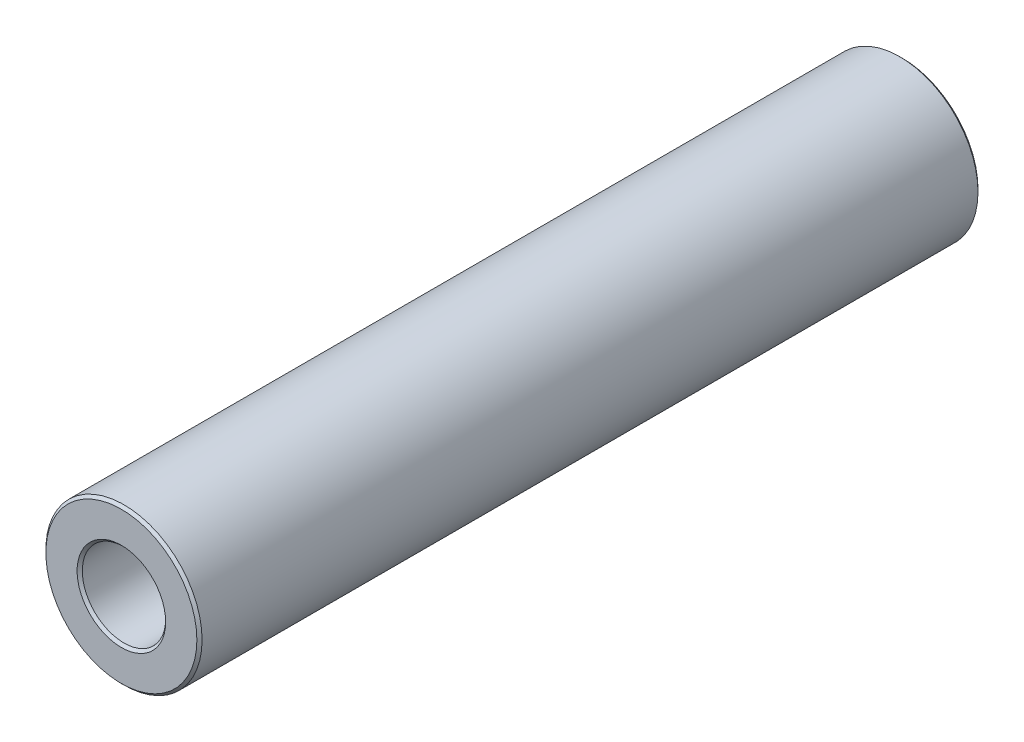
ISO-10303-21;
HEADER;
FILE_DESCRIPTION(('STEP AP214'),'2;1');
FILE_NAME('part.step','',(''),(''),'','','');
FILE_SCHEMA(('AUTOMOTIVE_DESIGN { 1 0 10303 214 1 1 1 1 }'));
ENDSEC;
DATA;
#1=APPLICATION_CONTEXT('core data for automotive mechanical design processes');
#2=APPLICATION_PROTOCOL_DEFINITION('international standard','automotive_design',2000,#1);
#3=PRODUCT_CONTEXT('',#1,'mechanical');
#4=PRODUCT('Part','Part','',(#3));
#5=PRODUCT_RELATED_PRODUCT_CATEGORY('part','',(#4));
#6=PRODUCT_DEFINITION_FORMATION('','',#4);
#7=PRODUCT_DEFINITION_CONTEXT('part definition',#1,'design');
#8=PRODUCT_DEFINITION('design','',#6,#7);
#9=PRODUCT_DEFINITION_SHAPE('','',#8);
#10=(LENGTH_UNIT() NAMED_UNIT(*) SI_UNIT(.MILLI.,.METRE.));
#11=(NAMED_UNIT(*) PLANE_ANGLE_UNIT() SI_UNIT($,.RADIAN.));
#12=(NAMED_UNIT(*) SI_UNIT($,.STERADIAN.) SOLID_ANGLE_UNIT());
#13=UNCERTAINTY_MEASURE_WITH_UNIT(LENGTH_MEASURE(1.E-05),#10,'distance_accuracy_value','');
#14=(GEOMETRIC_REPRESENTATION_CONTEXT(3) GLOBAL_UNCERTAINTY_ASSIGNED_CONTEXT((#13)) GLOBAL_UNIT_ASSIGNED_CONTEXT((#10,
#11,#12)) REPRESENTATION_CONTEXT('',''));
#15=CARTESIAN_POINT('',(0.,0.,0.));
#16=DIRECTION('',(0.,0.,1.));
#17=DIRECTION('',(1.,0.,0.));
#18=AXIS2_PLACEMENT_3D('',#15,#16,#17);
#19=CARTESIAN_POINT('',(0.,0.,15.));
#20=DIRECTION('',(0.,0.,1.));
#21=DIRECTION('',(1.,0.,0.));
#22=AXIS2_PLACEMENT_3D('',#19,#20,#21);
#23=PLANE('',#22);
#24=CARTESIAN_POINT('',(0.,0.,15.));
#25=DIRECTION('',(0.,0.,1.));
#26=DIRECTION('',(1.,0.,0.));
#27=AXIS2_PLACEMENT_3D('',#24,#25,#26);
#28=CIRCLE('',#27,1.7);
#29=CARTESIAN_POINT('',(1.7,0.,15.));
#30=VERTEX_POINT('',#29);
#31=EDGE_CURVE('E10',#30,#30,#28,.F.);
#32=ORIENTED_EDGE('',*,*,#31,.T.);
#33=EDGE_LOOP('',(#32));
#34=FACE_BOUND('',#33,.T.);
#35=CARTESIAN_POINT('',(0.,0.,15.));
#36=DIRECTION('',(0.,0.,1.));
#37=DIRECTION('',(1.,0.,0.));
#38=AXIS2_PLACEMENT_3D('',#35,#36,#37);
#39=CIRCLE('',#38,2.9);
#40=CARTESIAN_POINT('',(2.9,0.,15.));
#41=VERTEX_POINT('',#40);
#42=EDGE_CURVE('E45',#41,#41,#39,.T.);
#43=ORIENTED_EDGE('',*,*,#42,.T.);
#44=EDGE_LOOP('',(#43));
#45=FACE_BOUND('',#44,.T.);
#46=ADVANCED_FACE('F37',(#34,#45),#23,.T.);
#47=CARTESIAN_POINT('',(0.,0.,-15.));
#48=DIRECTION('',(0.,0.,1.));
#49=DIRECTION('',(1.,0.,0.));
#50=AXIS2_PLACEMENT_3D('',#47,#48,#49);
#51=PLANE('',#50);
#52=CARTESIAN_POINT('',(0.,0.,-15.));
#53=DIRECTION('',(0.,0.,1.));
#54=DIRECTION('',(1.,0.,0.));
#55=AXIS2_PLACEMENT_3D('',#52,#53,#54);
#56=CIRCLE('',#55,2.9);
#57=CARTESIAN_POINT('',(2.9,0.,-15.));
#58=VERTEX_POINT('',#57);
#59=EDGE_CURVE('E63',#58,#58,#56,.F.);
#60=ORIENTED_EDGE('',*,*,#59,.T.);
#61=EDGE_LOOP('',(#60));
#62=FACE_BOUND('',#61,.T.);
#63=CARTESIAN_POINT('',(0.,0.,-15.));
#64=DIRECTION('',(0.,0.,1.));
#65=DIRECTION('',(1.,0.,0.));
#66=AXIS2_PLACEMENT_3D('',#63,#64,#65);
#67=CIRCLE('',#66,1.7);
#68=CARTESIAN_POINT('',(1.7,0.,-15.));
#69=VERTEX_POINT('',#68);
#70=EDGE_CURVE('E66',#69,#69,#67,.T.);
#71=ORIENTED_EDGE('',*,*,#70,.T.);
#72=EDGE_LOOP('',(#71));
#73=FACE_BOUND('',#72,.T.);
#74=ADVANCED_FACE('F89',(#62,#73),#51,.F.);
#75=CARTESIAN_POINT('',(0.,0.,15.));
#76=DIRECTION('',(0.,0.,-1.));
#77=DIRECTION('',(-1.,0.,0.));
#78=AXIS2_PLACEMENT_3D('',#75,#76,#77);
#79=CYLINDRICAL_SURFACE('',#78,3.);
#80=CARTESIAN_POINT('',(0.,0.,-14.9));
#81=DIRECTION('',(0.,0.,1.));
#82=DIRECTION('',(1.,0.,0.));
#83=AXIS2_PLACEMENT_3D('',#80,#81,#82);
#84=CIRCLE('',#83,3.);
#85=CARTESIAN_POINT('',(3.,0.,-14.9));
#86=VERTEX_POINT('',#85);
#87=EDGE_CURVE('E69',#86,#86,#84,.T.);
#88=ORIENTED_EDGE('',*,*,#87,.T.);
#89=EDGE_LOOP('',(#88));
#90=FACE_BOUND('',#89,.T.);
#91=CARTESIAN_POINT('',(0.,0.,14.9));
#92=DIRECTION('',(0.,0.,1.));
#93=DIRECTION('',(1.,0.,0.));
#94=AXIS2_PLACEMENT_3D('',#91,#92,#93);
#95=CIRCLE('',#94,3.);
#96=CARTESIAN_POINT('',(3.,0.,14.9));
#97=VERTEX_POINT('',#96);
#98=EDGE_CURVE('E73',#97,#97,#95,.F.);
#99=ORIENTED_EDGE('',*,*,#98,.T.);
#100=EDGE_LOOP('',(#99));
#101=FACE_BOUND('',#100,.T.);
#102=ADVANCED_FACE('F78',(#90,#101),#79,.T.);
#103=CARTESIAN_POINT('',(0.,0.,15.));
#104=DIRECTION('',(0.,0.,-1.));
#105=DIRECTION('',(-1.,0.,0.));
#106=AXIS2_PLACEMENT_3D('',#103,#104,#105);
#107=CYLINDRICAL_SURFACE('',#106,1.6);
#108=CARTESIAN_POINT('',(0.,0.,-14.9));
#109=DIRECTION('',(0.,0.,1.));
#110=DIRECTION('',(1.,0.,0.));
#111=AXIS2_PLACEMENT_3D('',#108,#109,#110);
#112=CIRCLE('',#111,1.6);
#113=CARTESIAN_POINT('',(1.6,0.,-14.9));
#114=VERTEX_POINT('',#113);
#115=EDGE_CURVE('E51',#114,#114,#112,.F.);
#116=ORIENTED_EDGE('',*,*,#115,.T.);
#117=EDGE_LOOP('',(#116));
#118=FACE_BOUND('',#117,.T.);
#119=CARTESIAN_POINT('',(0.,0.,14.9));
#120=DIRECTION('',(0.,0.,1.));
#121=DIRECTION('',(1.,0.,0.));
#122=AXIS2_PLACEMENT_3D('',#119,#120,#121);
#123=CIRCLE('',#122,1.6);
#124=CARTESIAN_POINT('',(1.6,0.,14.9));
#125=VERTEX_POINT('',#124);
#126=EDGE_CURVE('E57',#125,#125,#123,.T.);
#127=ORIENTED_EDGE('',*,*,#126,.T.);
#128=EDGE_LOOP('',(#127));
#129=FACE_BOUND('',#128,.T.);
#130=ADVANCED_FACE('F97',(#118,#129),#107,.F.);
#131=CARTESIAN_POINT('',(0.,0.,-14.9));
#132=DIRECTION('',(0.,0.,1.));
#133=DIRECTION('',(1.,0.,0.));
#134=AXIS2_PLACEMENT_3D('',#131,#132,#133);
#135=CONICAL_SURFACE('',#134,3.,0.785398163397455);
#136=ORIENTED_EDGE('',*,*,#59,.F.);
#137=EDGE_LOOP('',(#136));
#138=FACE_BOUND('',#137,.T.);
#139=ORIENTED_EDGE('',*,*,#87,.F.);
#140=EDGE_LOOP('',(#139));
#141=FACE_BOUND('',#140,.T.);
#142=ADVANCED_FACE('F102',(#138,#141),#135,.T.);
#143=CARTESIAN_POINT('',(0.,0.,-15.));
#144=DIRECTION('',(0.,0.,-1.));
#145=DIRECTION('',(-1.,0.,0.));
#146=AXIS2_PLACEMENT_3D('',#143,#144,#145);
#147=CONICAL_SURFACE('',#146,1.7,0.785398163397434);
#148=ORIENTED_EDGE('',*,*,#115,.F.);
#149=EDGE_LOOP('',(#148));
#150=FACE_BOUND('',#149,.T.);
#151=ORIENTED_EDGE('',*,*,#70,.F.);
#152=EDGE_LOOP('',(#151));
#153=FACE_BOUND('',#152,.T.);
#154=ADVANCED_FACE('F86',(#150,#153),#147,.F.);
#155=CARTESIAN_POINT('',(0.,0.,14.9));
#156=DIRECTION('',(0.,0.,1.));
#157=DIRECTION('',(1.,0.,0.));
#158=AXIS2_PLACEMENT_3D('',#155,#156,#157);
#159=CONICAL_SURFACE('',#158,1.6,0.785398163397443);
#160=ORIENTED_EDGE('',*,*,#31,.F.);
#161=EDGE_LOOP('',(#160));
#162=FACE_BOUND('',#161,.T.);
#163=ORIENTED_EDGE('',*,*,#126,.F.);
#164=EDGE_LOOP('',(#163));
#165=FACE_BOUND('',#164,.T.);
#166=ADVANCED_FACE('F82',(#162,#165),#159,.F.);
#167=CARTESIAN_POINT('',(0.,0.,15.));
#168=DIRECTION('',(0.,0.,-1.));
#169=DIRECTION('',(-1.,0.,0.));
#170=AXIS2_PLACEMENT_3D('',#167,#168,#169);
#171=CONICAL_SURFACE('',#170,2.9,0.78539816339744);
#172=ORIENTED_EDGE('',*,*,#98,.F.);
#173=EDGE_LOOP('',(#172));
#174=FACE_BOUND('',#173,.T.);
#175=ORIENTED_EDGE('',*,*,#42,.F.);
#176=EDGE_LOOP('',(#175));
#177=FACE_BOUND('',#176,.T.);
#178=ADVANCED_FACE('F39',(#174,#177),#171,.T.);
#179=CLOSED_SHELL('',(#46,#74,#102,#130,#142,#154,#166,#178));
#180=MANIFOLD_SOLID_BREP('B2',#179);
#181=ADVANCED_BREP_SHAPE_REPRESENTATION('',(#18,#180),#14);
#182=SHAPE_DEFINITION_REPRESENTATION(#9,#181);
ENDSEC;
END-ISO-10303-21;
